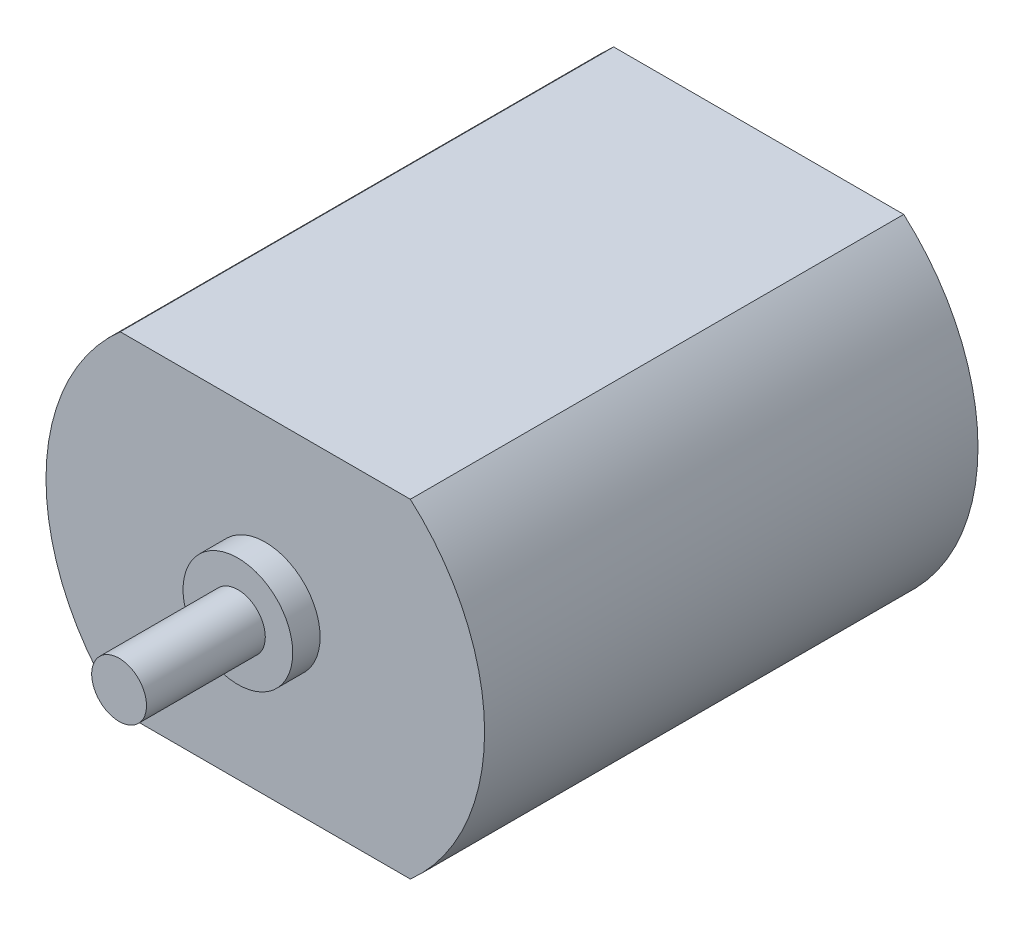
ISO-10303-21;
HEADER;
FILE_DESCRIPTION(('STEP AP214'),'2;1');
FILE_NAME('part.step','',(''),(''),'','','');
FILE_SCHEMA(('AUTOMOTIVE_DESIGN { 1 0 10303 214 1 1 1 1 }'));
ENDSEC;
DATA;
#1=APPLICATION_CONTEXT('core data for automotive mechanical design processes');
#2=APPLICATION_PROTOCOL_DEFINITION('international standard','automotive_design',2000,#1);
#3=PRODUCT_CONTEXT('',#1,'mechanical');
#4=PRODUCT('Part','Part','',(#3));
#5=PRODUCT_RELATED_PRODUCT_CATEGORY('part','',(#4));
#6=PRODUCT_DEFINITION_FORMATION('','',#4);
#7=PRODUCT_DEFINITION_CONTEXT('part definition',#1,'design');
#8=PRODUCT_DEFINITION('design','',#6,#7);
#9=PRODUCT_DEFINITION_SHAPE('','',#8);
#10=(LENGTH_UNIT() NAMED_UNIT(*) SI_UNIT(.MILLI.,.METRE.));
#11=(NAMED_UNIT(*) PLANE_ANGLE_UNIT() SI_UNIT($,.RADIAN.));
#12=(NAMED_UNIT(*) SI_UNIT($,.STERADIAN.) SOLID_ANGLE_UNIT());
#13=UNCERTAINTY_MEASURE_WITH_UNIT(LENGTH_MEASURE(1.E-05),#10,'distance_accuracy_value','');
#14=(GEOMETRIC_REPRESENTATION_CONTEXT(3) GLOBAL_UNCERTAINTY_ASSIGNED_CONTEXT((#13)) GLOBAL_UNIT_ASSIGNED_CONTEXT((#10,
#11,#12)) REPRESENTATION_CONTEXT('',''));
#15=CARTESIAN_POINT('',(0.,0.,0.));
#16=DIRECTION('',(0.,0.,1.));
#17=DIRECTION('',(1.,0.,0.));
#18=AXIS2_PLACEMENT_3D('',#15,#16,#17);
#19=CARTESIAN_POINT('',(0.,0.,-27.));
#20=DIRECTION('',(0.,0.,1.));
#21=DIRECTION('',(1.,0.,0.));
#22=AXIS2_PLACEMENT_3D('',#19,#20,#21);
#23=PLANE('',#22);
#24=CARTESIAN_POINT('',(0.,0.,-27.));
#25=DIRECTION('',(0.,0.,1.));
#26=DIRECTION('',(1.,0.,0.));
#27=AXIS2_PLACEMENT_3D('',#24,#25,#26);
#28=CIRCLE('',#27,12.);
#29=CARTESIAN_POINT('',(-7.93725393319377,9.,-27.));
#30=VERTEX_POINT('',#29);
#31=CARTESIAN_POINT('',(-7.93725393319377,-9.,-27.));
#32=VERTEX_POINT('',#31);
#33=EDGE_CURVE('E445',#30,#32,#28,.T.);
#34=ORIENTED_EDGE('',*,*,#33,.F.);
#35=DIRECTION('',(-1.,0.,0.));
#36=VECTOR('',#35,1.);
#37=CARTESIAN_POINT('',(-7.93725393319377,9.,-27.));
#38=LINE('',#37,#36);
#39=CARTESIAN_POINT('',(7.93725393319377,9.,-27.));
#40=VERTEX_POINT('',#39);
#41=EDGE_CURVE('E453',#40,#30,#38,.T.);
#42=ORIENTED_EDGE('',*,*,#41,.F.);
#43=CARTESIAN_POINT('',(0.,0.,-27.));
#44=DIRECTION('',(0.,0.,1.));
#45=DIRECTION('',(1.,0.,0.));
#46=AXIS2_PLACEMENT_3D('',#43,#44,#45);
#47=CIRCLE('',#46,12.);
#48=CARTESIAN_POINT('',(7.93725393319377,-9.,-27.));
#49=VERTEX_POINT('',#48);
#50=EDGE_CURVE('E450',#49,#40,#47,.T.);
#51=ORIENTED_EDGE('',*,*,#50,.F.);
#52=DIRECTION('',(1.,0.,0.));
#53=VECTOR('',#52,1.);
#54=CARTESIAN_POINT('',(-7.93725393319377,-9.,-27.));
#55=LINE('',#54,#53);
#56=EDGE_CURVE('E447',#32,#49,#55,.T.);
#57=ORIENTED_EDGE('',*,*,#56,.F.);
#58=EDGE_LOOP('',(#34,#42,#51,#57));
#59=FACE_BOUND('',#58,.T.);
#60=CARTESIAN_POINT('',(0.,0.,-27.));
#61=DIRECTION('',(0.,0.,-1.));
#62=DIRECTION('',(-1.,0.,0.));
#63=AXIS2_PLACEMENT_3D('',#60,#61,#62);
#64=CIRCLE('',#63,4.);
#65=CARTESIAN_POINT('',(1.93649167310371,3.5,-27.));
#66=VERTEX_POINT('',#65);
#67=CARTESIAN_POINT('',(-1.93649167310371,3.5,-27.));
#68=VERTEX_POINT('',#67);
#69=EDGE_CURVE('E400',#66,#68,#64,.T.);
#70=ORIENTED_EDGE('',*,*,#69,.F.);
#71=DIRECTION('',(1.,0.,0.));
#72=VECTOR('',#71,1.);
#73=CARTESIAN_POINT('',(-1.93649167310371,3.5,-27.));
#74=LINE('',#73,#72);
#75=EDGE_CURVE('E364',#68,#66,#74,.T.);
#76=ORIENTED_EDGE('',*,*,#75,.F.);
#77=EDGE_LOOP('',(#70,#76));
#78=FACE_BOUND('',#77,.T.);
#79=ADVANCED_FACE('F348',(#59,#78),#23,.F.);
#80=CARTESIAN_POINT('',(0.,0.,1.5));
#81=DIRECTION('',(0.,0.,1.));
#82=DIRECTION('',(1.,0.,0.));
#83=AXIS2_PLACEMENT_3D('',#80,#81,#82);
#84=PLANE('',#83);
#85=CARTESIAN_POINT('',(0.,0.,1.5));
#86=DIRECTION('',(0.,0.,1.));
#87=DIRECTION('',(1.,0.,0.));
#88=AXIS2_PLACEMENT_3D('',#85,#86,#87);
#89=CIRCLE('',#88,3.);
#90=CARTESIAN_POINT('',(3.,0.,1.5));
#91=VERTEX_POINT('',#90);
#92=EDGE_CURVE('E430',#91,#91,#89,.T.);
#93=ORIENTED_EDGE('',*,*,#92,.T.);
#94=EDGE_LOOP('',(#93));
#95=FACE_BOUND('',#94,.T.);
#96=CARTESIAN_POINT('',(0.,0.,1.5));
#97=DIRECTION('',(0.,0.,1.));
#98=DIRECTION('',(1.,0.,0.));
#99=AXIS2_PLACEMENT_3D('',#96,#97,#98);
#100=CIRCLE('',#99,1.5);
#101=CARTESIAN_POINT('',(1.5,0.,1.5));
#102=VERTEX_POINT('',#101);
#103=EDGE_CURVE('E417',#102,#102,#100,.T.);
#104=ORIENTED_EDGE('',*,*,#103,.F.);
#105=EDGE_LOOP('',(#104));
#106=FACE_BOUND('',#105,.T.);
#107=ADVANCED_FACE('F482',(#95,#106),#84,.T.);
#108=CARTESIAN_POINT('',(0.,0.,0.));
#109=DIRECTION('',(0.,0.,1.));
#110=DIRECTION('',(1.,0.,0.));
#111=AXIS2_PLACEMENT_3D('',#108,#109,#110);
#112=PLANE('',#111);
#113=CARTESIAN_POINT('',(0.,0.,0.));
#114=DIRECTION('',(0.,0.,1.));
#115=DIRECTION('',(1.,0.,0.));
#116=AXIS2_PLACEMENT_3D('',#113,#114,#115);
#117=CIRCLE('',#116,12.);
#118=CARTESIAN_POINT('',(-7.93725393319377,9.,0.));
#119=VERTEX_POINT('',#118);
#120=CARTESIAN_POINT('',(-7.93725393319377,-9.,0.));
#121=VERTEX_POINT('',#120);
#122=EDGE_CURVE('E433',#119,#121,#117,.T.);
#123=ORIENTED_EDGE('',*,*,#122,.T.);
#124=DIRECTION('',(1.,0.,0.));
#125=VECTOR('',#124,1.);
#126=CARTESIAN_POINT('',(-7.93725393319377,-9.,0.));
#127=LINE('',#126,#125);
#128=CARTESIAN_POINT('',(7.93725393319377,-9.,0.));
#129=VERTEX_POINT('',#128);
#130=EDGE_CURVE('E436',#121,#129,#127,.T.);
#131=ORIENTED_EDGE('',*,*,#130,.T.);
#132=CARTESIAN_POINT('',(0.,0.,0.));
#133=DIRECTION('',(0.,0.,1.));
#134=DIRECTION('',(1.,0.,0.));
#135=AXIS2_PLACEMENT_3D('',#132,#133,#134);
#136=CIRCLE('',#135,12.);
#137=CARTESIAN_POINT('',(7.93725393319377,9.,0.));
#138=VERTEX_POINT('',#137);
#139=EDGE_CURVE('E439',#129,#138,#136,.T.);
#140=ORIENTED_EDGE('',*,*,#139,.T.);
#141=DIRECTION('',(-1.,0.,0.));
#142=VECTOR('',#141,1.);
#143=CARTESIAN_POINT('',(-7.93725393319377,9.,0.));
#144=LINE('',#143,#142);
#145=EDGE_CURVE('E442',#138,#119,#144,.T.);
#146=ORIENTED_EDGE('',*,*,#145,.T.);
#147=EDGE_LOOP('',(#123,#131,#140,#146));
#148=FACE_BOUND('',#147,.T.);
#149=CARTESIAN_POINT('',(0.,0.,0.));
#150=DIRECTION('',(0.,0.,1.));
#151=DIRECTION('',(1.,0.,0.));
#152=AXIS2_PLACEMENT_3D('',#149,#150,#151);
#153=CIRCLE('',#152,3.);
#154=CARTESIAN_POINT('',(3.,0.,0.));
#155=VERTEX_POINT('',#154);
#156=EDGE_CURVE('E427',#155,#155,#153,.T.);
#157=ORIENTED_EDGE('',*,*,#156,.F.);
#158=EDGE_LOOP('',(#157));
#159=FACE_BOUND('',#158,.T.);
#160=ADVANCED_FACE('F463',(#148,#159),#112,.T.);
#161=CARTESIAN_POINT('',(0.,0.,-27.));
#162=DIRECTION('',(0.,0.,1.));
#163=DIRECTION('',(1.,0.,0.));
#164=AXIS2_PLACEMENT_3D('',#161,#162,#163);
#165=CYLINDRICAL_SURFACE('',#164,12.);
#166=ORIENTED_EDGE('',*,*,#122,.F.);
#167=DIRECTION('',(0.,0.,1.));
#168=VECTOR('',#167,1.);
#169=CARTESIAN_POINT('',(-7.93725393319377,9.,-27.));
#170=LINE('',#169,#168);
#171=EDGE_CURVE('E11',#30,#119,#170,.T.);
#172=ORIENTED_EDGE('',*,*,#171,.F.);
#173=ORIENTED_EDGE('',*,*,#33,.T.);
#174=DIRECTION('',(0.,0.,1.));
#175=VECTOR('',#174,1.);
#176=CARTESIAN_POINT('',(-7.93725393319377,-9.,-27.));
#177=LINE('',#176,#175);
#178=EDGE_CURVE('E352',#32,#121,#177,.T.);
#179=ORIENTED_EDGE('',*,*,#178,.T.);
#180=EDGE_LOOP('',(#166,#172,#173,#179));
#181=FACE_BOUND('',#180,.T.);
#182=ADVANCED_FACE('F350',(#181),#165,.T.);
#183=CARTESIAN_POINT('',(-7.93725393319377,9.,-27.));
#184=DIRECTION('',(0.,1.,0.));
#185=DIRECTION('',(0.,0.,1.));
#186=AXIS2_PLACEMENT_3D('',#183,#184,#185);
#187=PLANE('',#186);
#188=ORIENTED_EDGE('',*,*,#145,.F.);
#189=DIRECTION('',(0.,0.,1.));
#190=VECTOR('',#189,1.);
#191=CARTESIAN_POINT('',(7.93725393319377,9.,-27.));
#192=LINE('',#191,#190);
#193=EDGE_CURVE('E357',#40,#138,#192,.T.);
#194=ORIENTED_EDGE('',*,*,#193,.F.);
#195=ORIENTED_EDGE('',*,*,#41,.T.);
#196=ORIENTED_EDGE('',*,*,#171,.T.);
#197=EDGE_LOOP('',(#188,#194,#195,#196));
#198=FACE_BOUND('',#197,.T.);
#199=ADVANCED_FACE('F467',(#198),#187,.T.);
#200=CARTESIAN_POINT('',(0.,0.,-27.));
#201=DIRECTION('',(0.,0.,1.));
#202=DIRECTION('',(1.,0.,0.));
#203=AXIS2_PLACEMENT_3D('',#200,#201,#202);
#204=CYLINDRICAL_SURFACE('',#203,12.);
#205=ORIENTED_EDGE('',*,*,#139,.F.);
#206=DIRECTION('',(0.,0.,1.));
#207=VECTOR('',#206,1.);
#208=CARTESIAN_POINT('',(7.93725393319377,-9.,-27.));
#209=LINE('',#208,#207);
#210=EDGE_CURVE('E456',#49,#129,#209,.T.);
#211=ORIENTED_EDGE('',*,*,#210,.F.);
#212=ORIENTED_EDGE('',*,*,#50,.T.);
#213=ORIENTED_EDGE('',*,*,#193,.T.);
#214=EDGE_LOOP('',(#205,#211,#212,#213));
#215=FACE_BOUND('',#214,.T.);
#216=ADVANCED_FACE('F472',(#215),#204,.T.);
#217=CARTESIAN_POINT('',(-7.93725393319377,-9.,-27.));
#218=DIRECTION('',(0.,-1.,0.));
#219=DIRECTION('',(0.,0.,-1.));
#220=AXIS2_PLACEMENT_3D('',#217,#218,#219);
#221=PLANE('',#220);
#222=ORIENTED_EDGE('',*,*,#130,.F.);
#223=ORIENTED_EDGE('',*,*,#178,.F.);
#224=ORIENTED_EDGE('',*,*,#56,.T.);
#225=ORIENTED_EDGE('',*,*,#210,.T.);
#226=EDGE_LOOP('',(#222,#223,#224,#225));
#227=FACE_BOUND('',#226,.T.);
#228=ADVANCED_FACE('F461',(#227),#221,.T.);
#229=CARTESIAN_POINT('',(0.,0.,1.5));
#230=DIRECTION('',(0.,0.,-1.));
#231=DIRECTION('',(-1.,0.,0.));
#232=AXIS2_PLACEMENT_3D('',#229,#230,#231);
#233=CYLINDRICAL_SURFACE('',#232,3.);
#234=ORIENTED_EDGE('',*,*,#92,.F.);
#235=EDGE_LOOP('',(#234));
#236=FACE_BOUND('',#235,.T.);
#237=ORIENTED_EDGE('',*,*,#156,.T.);
#238=EDGE_LOOP('',(#237));
#239=FACE_BOUND('',#238,.T.);
#240=ADVANCED_FACE('F479',(#236,#239),#233,.T.);
#241=CARTESIAN_POINT('',(0.,0.,8.));
#242=DIRECTION('',(0.,0.,-1.));
#243=DIRECTION('',(-1.,0.,0.));
#244=AXIS2_PLACEMENT_3D('',#241,#242,#243);
#245=CYLINDRICAL_SURFACE('',#244,1.5);
#246=CARTESIAN_POINT('',(0.,0.,8.));
#247=DIRECTION('',(0.,0.,1.));
#248=DIRECTION('',(1.,0.,0.));
#249=AXIS2_PLACEMENT_3D('',#246,#247,#248);
#250=CIRCLE('',#249,1.5);
#251=CARTESIAN_POINT('',(1.5,0.,8.));
#252=VERTEX_POINT('',#251);
#253=EDGE_CURVE('E424',#252,#252,#250,.T.);
#254=ORIENTED_EDGE('',*,*,#253,.F.);
#255=EDGE_LOOP('',(#254));
#256=FACE_BOUND('',#255,.T.);
#257=ORIENTED_EDGE('',*,*,#103,.T.);
#258=EDGE_LOOP('',(#257));
#259=FACE_BOUND('',#258,.T.);
#260=ADVANCED_FACE('F493',(#256,#259),#245,.T.);
#261=CARTESIAN_POINT('',(0.,0.,8.));
#262=DIRECTION('',(0.,0.,1.));
#263=DIRECTION('',(1.,0.,0.));
#264=AXIS2_PLACEMENT_3D('',#261,#262,#263);
#265=PLANE('',#264);
#266=ORIENTED_EDGE('',*,*,#253,.T.);
#267=EDGE_LOOP('',(#266));
#268=FACE_BOUND('',#267,.T.);
#269=ADVANCED_FACE('F498',(#268),#265,.T.);
#270=CARTESIAN_POINT('',(0.,0.,-29.));
#271=DIRECTION('',(0.,0.,1.));
#272=DIRECTION('',(1.,0.,0.));
#273=AXIS2_PLACEMENT_3D('',#270,#271,#272);
#274=CYLINDRICAL_SURFACE('',#273,4.);
#275=ORIENTED_EDGE('',*,*,#69,.T.);
#276=DIRECTION('',(0.,0.,1.));
#277=VECTOR('',#276,1.);
#278=CARTESIAN_POINT('',(-1.93649167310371,3.5,-29.));
#279=LINE('',#278,#277);
#280=CARTESIAN_POINT('',(-1.93649167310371,3.5,-29.));
#281=VERTEX_POINT('',#280);
#282=EDGE_CURVE('E410',#281,#68,#279,.T.);
#283=ORIENTED_EDGE('',*,*,#282,.F.);
#284=CARTESIAN_POINT('',(0.,0.,-29.));
#285=DIRECTION('',(0.,0.,-1.));
#286=DIRECTION('',(-1.,0.,0.));
#287=AXIS2_PLACEMENT_3D('',#284,#285,#286);
#288=CIRCLE('',#287,4.);
#289=CARTESIAN_POINT('',(1.93649167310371,3.5,-29.));
#290=VERTEX_POINT('',#289);
#291=EDGE_CURVE('E411',#290,#281,#288,.T.);
#292=ORIENTED_EDGE('',*,*,#291,.F.);
#293=DIRECTION('',(0.,0.,1.));
#294=VECTOR('',#293,1.);
#295=CARTESIAN_POINT('',(1.93649167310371,3.5,-29.));
#296=LINE('',#295,#294);
#297=EDGE_CURVE('E408',#290,#66,#296,.T.);
#298=ORIENTED_EDGE('',*,*,#297,.T.);
#299=EDGE_LOOP('',(#275,#283,#292,#298));
#300=FACE_BOUND('',#299,.T.);
#301=ADVANCED_FACE('F413',(#300),#274,.T.);
#302=CARTESIAN_POINT('',(-1.93649167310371,3.5,-29.));
#303=DIRECTION('',(0.,-1.,0.));
#304=DIRECTION('',(0.,0.,-1.));
#305=AXIS2_PLACEMENT_3D('',#302,#303,#304);
#306=PLANE('',#305);
#307=ORIENTED_EDGE('',*,*,#75,.T.);
#308=ORIENTED_EDGE('',*,*,#297,.F.);
#309=DIRECTION('',(1.,0.,0.));
#310=VECTOR('',#309,1.);
#311=CARTESIAN_POINT('',(-1.93649167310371,3.5,-29.));
#312=LINE('',#311,#310);
#313=EDGE_CURVE('E415',#281,#290,#312,.T.);
#314=ORIENTED_EDGE('',*,*,#313,.F.);
#315=ORIENTED_EDGE('',*,*,#282,.T.);
#316=EDGE_LOOP('',(#307,#308,#314,#315));
#317=FACE_BOUND('',#316,.T.);
#318=ADVANCED_FACE('F407',(#317),#306,.F.);
#319=CARTESIAN_POINT('',(0.,0.,-29.));
#320=DIRECTION('',(0.,0.,-1.));
#321=DIRECTION('',(-1.,0.,0.));
#322=AXIS2_PLACEMENT_3D('',#319,#320,#321);
#323=PLANE('',#322);
#324=ORIENTED_EDGE('',*,*,#291,.T.);
#325=ORIENTED_EDGE('',*,*,#313,.T.);
#326=EDGE_LOOP('',(#324,#325));
#327=FACE_BOUND('',#326,.T.);
#328=ADVANCED_FACE('F507',(#327),#323,.T.);
#329=CLOSED_SHELL('',(#79,#107,#160,#182,#199,#216,#228,#240,#260,#269,#301,#318,#328));
#330=MANIFOLD_SOLID_BREP('B2',#329);
#331=ADVANCED_BREP_SHAPE_REPRESENTATION('',(#18,#330),#14);
#332=SHAPE_DEFINITION_REPRESENTATION(#9,#331);
ENDSEC;
END-ISO-10303-21;
